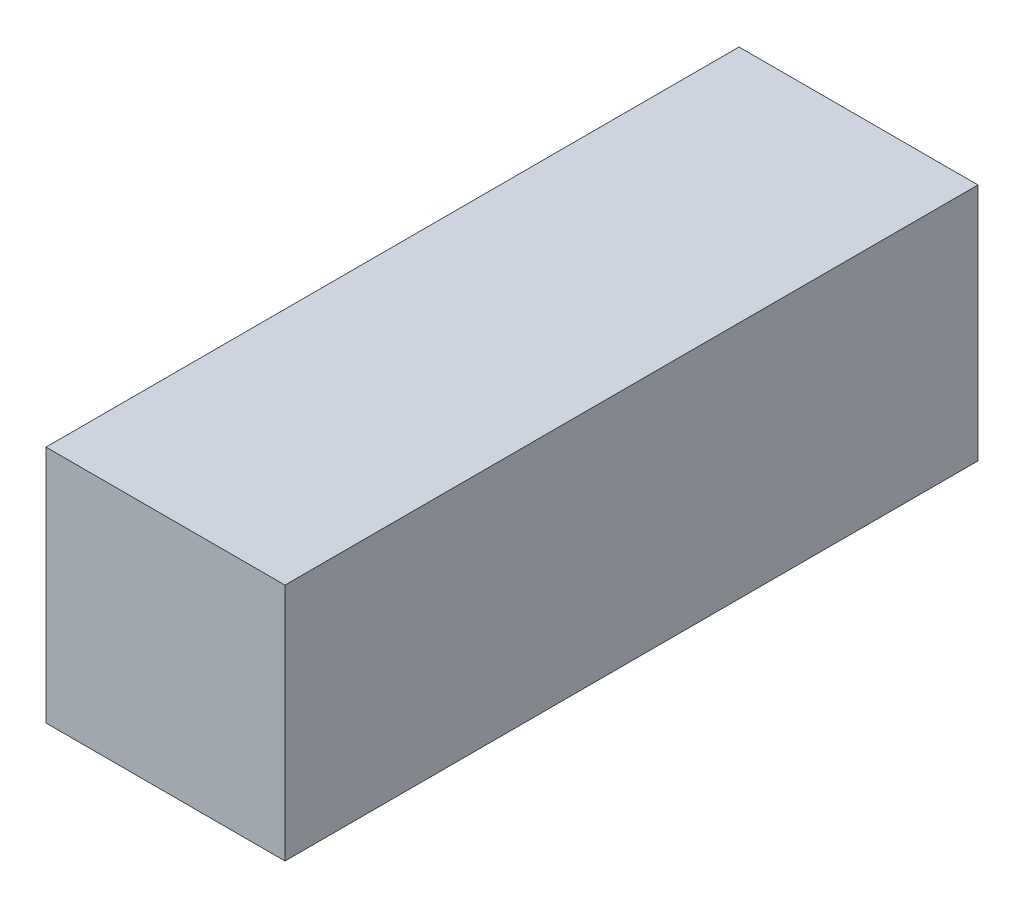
ISO-10303-21;
HEADER;
FILE_DESCRIPTION(('STEP AP214'),'2;1');
FILE_NAME('part.step','',(''),(''),'','','');
FILE_SCHEMA(('AUTOMOTIVE_DESIGN { 1 0 10303 214 1 1 1 1 }'));
ENDSEC;
DATA;
#1=APPLICATION_CONTEXT('core data for automotive mechanical design processes');
#2=APPLICATION_PROTOCOL_DEFINITION('international standard','automotive_design',2000,#1);
#3=PRODUCT_CONTEXT('',#1,'mechanical');
#4=PRODUCT('Part','Part','',(#3));
#5=PRODUCT_RELATED_PRODUCT_CATEGORY('part','',(#4));
#6=PRODUCT_DEFINITION_FORMATION('','',#4);
#7=PRODUCT_DEFINITION_CONTEXT('part definition',#1,'design');
#8=PRODUCT_DEFINITION('design','',#6,#7);
#9=PRODUCT_DEFINITION_SHAPE('','',#8);
#10=(LENGTH_UNIT() NAMED_UNIT(*) SI_UNIT(.MILLI.,.METRE.));
#11=(NAMED_UNIT(*) PLANE_ANGLE_UNIT() SI_UNIT($,.RADIAN.));
#12=(NAMED_UNIT(*) SI_UNIT($,.STERADIAN.) SOLID_ANGLE_UNIT());
#13=UNCERTAINTY_MEASURE_WITH_UNIT(LENGTH_MEASURE(1.E-05),#10,'distance_accuracy_value','');
#14=(GEOMETRIC_REPRESENTATION_CONTEXT(3) GLOBAL_UNCERTAINTY_ASSIGNED_CONTEXT((#13)) GLOBAL_UNIT_ASSIGNED_CONTEXT((#10,
#11,#12)) REPRESENTATION_CONTEXT('',''));
#15=CARTESIAN_POINT('',(0.,0.,0.));
#16=DIRECTION('',(0.,0.,1.));
#17=DIRECTION('',(1.,0.,0.));
#18=AXIS2_PLACEMENT_3D('',#15,#16,#17);
#19=CARTESIAN_POINT('',(0.,0.,58.));
#20=DIRECTION('',(1.,0.,0.));
#21=DIRECTION('',(0.,0.,-1.));
#22=AXIS2_PLACEMENT_3D('',#19,#20,#21);
#23=PLANE('',#22);
#24=DIRECTION('',(0.,-1.,0.));
#25=VECTOR('',#24,1.);
#26=CARTESIAN_POINT('',(0.,0.,0.));
#27=LINE('',#26,#25);
#28=CARTESIAN_POINT('',(0.,20.,0.));
#29=VERTEX_POINT('',#28);
#30=CARTESIAN_POINT('',(0.,0.,0.));
#31=VERTEX_POINT('',#30);
#32=EDGE_CURVE('E105',#29,#31,#27,.T.);
#33=ORIENTED_EDGE('',*,*,#32,.T.);
#34=DIRECTION('',(0.,0.,-1.));
#35=VECTOR('',#34,1.);
#36=CARTESIAN_POINT('',(0.,0.,58.));
#37=LINE('',#36,#35);
#38=CARTESIAN_POINT('',(0.,0.,58.));
#39=VERTEX_POINT('',#38);
#40=EDGE_CURVE('E11',#39,#31,#37,.T.);
#41=ORIENTED_EDGE('',*,*,#40,.F.);
#42=DIRECTION('',(0.,-1.,0.));
#43=VECTOR('',#42,1.);
#44=CARTESIAN_POINT('',(0.,0.,58.));
#45=LINE('',#44,#43);
#46=CARTESIAN_POINT('',(0.,20.,58.));
#47=VERTEX_POINT('',#46);
#48=EDGE_CURVE('E89',#47,#39,#45,.T.);
#49=ORIENTED_EDGE('',*,*,#48,.F.);
#50=DIRECTION('',(0.,0.,-1.));
#51=VECTOR('',#50,1.);
#52=CARTESIAN_POINT('',(0.,20.,58.));
#53=LINE('',#52,#51);
#54=EDGE_CURVE('E98',#47,#29,#53,.T.);
#55=ORIENTED_EDGE('',*,*,#54,.T.);
#56=EDGE_LOOP('',(#33,#41,#49,#55));
#57=FACE_BOUND('',#56,.T.);
#58=ADVANCED_FACE('F39',(#57),#23,.F.);
#59=CARTESIAN_POINT('',(0.,0.,58.));
#60=DIRECTION('',(0.,1.,0.));
#61=DIRECTION('',(0.,0.,1.));
#62=AXIS2_PLACEMENT_3D('',#59,#60,#61);
#63=PLANE('',#62);
#64=DIRECTION('',(1.,0.,0.));
#65=VECTOR('',#64,1.);
#66=CARTESIAN_POINT('',(0.,0.,0.));
#67=LINE('',#66,#65);
#68=CARTESIAN_POINT('',(20.,0.,0.));
#69=VERTEX_POINT('',#68);
#70=EDGE_CURVE('E94',#31,#69,#67,.T.);
#71=ORIENTED_EDGE('',*,*,#70,.T.);
#72=DIRECTION('',(0.,0.,-1.));
#73=VECTOR('',#72,1.);
#74=CARTESIAN_POINT('',(20.,0.,58.));
#75=LINE('',#74,#73);
#76=CARTESIAN_POINT('',(20.,0.,58.));
#77=VERTEX_POINT('',#76);
#78=EDGE_CURVE('E50',#77,#69,#75,.T.);
#79=ORIENTED_EDGE('',*,*,#78,.F.);
#80=DIRECTION('',(1.,0.,0.));
#81=VECTOR('',#80,1.);
#82=CARTESIAN_POINT('',(0.,0.,58.));
#83=LINE('',#82,#81);
#84=EDGE_CURVE('E83',#39,#77,#83,.T.);
#85=ORIENTED_EDGE('',*,*,#84,.F.);
#86=ORIENTED_EDGE('',*,*,#40,.T.);
#87=EDGE_LOOP('',(#71,#79,#85,#86));
#88=FACE_BOUND('',#87,.T.);
#89=ADVANCED_FACE('F91',(#88),#63,.F.);
#90=CARTESIAN_POINT('',(20.,0.,58.));
#91=DIRECTION('',(-1.,0.,0.));
#92=DIRECTION('',(0.,0.,1.));
#93=AXIS2_PLACEMENT_3D('',#90,#91,#92);
#94=PLANE('',#93);
#95=DIRECTION('',(0.,1.,0.));
#96=VECTOR('',#95,1.);
#97=CARTESIAN_POINT('',(20.,0.,0.));
#98=LINE('',#97,#96);
#99=CARTESIAN_POINT('',(20.,20.,0.));
#100=VERTEX_POINT('',#99);
#101=EDGE_CURVE('E75',#69,#100,#98,.T.);
#102=ORIENTED_EDGE('',*,*,#101,.T.);
#103=DIRECTION('',(0.,0.,-1.));
#104=VECTOR('',#103,1.);
#105=CARTESIAN_POINT('',(20.,20.,58.));
#106=LINE('',#105,#104);
#107=CARTESIAN_POINT('',(20.,20.,58.));
#108=VERTEX_POINT('',#107);
#109=EDGE_CURVE('E92',#108,#100,#106,.T.);
#110=ORIENTED_EDGE('',*,*,#109,.F.);
#111=DIRECTION('',(0.,1.,0.));
#112=VECTOR('',#111,1.);
#113=CARTESIAN_POINT('',(20.,0.,58.));
#114=LINE('',#113,#112);
#115=EDGE_CURVE('E86',#77,#108,#114,.T.);
#116=ORIENTED_EDGE('',*,*,#115,.F.);
#117=ORIENTED_EDGE('',*,*,#78,.T.);
#118=EDGE_LOOP('',(#102,#110,#116,#117));
#119=FACE_BOUND('',#118,.T.);
#120=ADVANCED_FACE('F96',(#119),#94,.F.);
#121=CARTESIAN_POINT('',(0.,20.,58.));
#122=DIRECTION('',(0.,-1.,0.));
#123=DIRECTION('',(0.,0.,-1.));
#124=AXIS2_PLACEMENT_3D('',#121,#122,#123);
#125=PLANE('',#124);
#126=DIRECTION('',(-1.,0.,0.));
#127=VECTOR('',#126,1.);
#128=CARTESIAN_POINT('',(0.,20.,0.));
#129=LINE('',#128,#127);
#130=EDGE_CURVE('E77',#100,#29,#129,.T.);
#131=ORIENTED_EDGE('',*,*,#130,.T.);
#132=ORIENTED_EDGE('',*,*,#54,.F.);
#133=DIRECTION('',(-1.,0.,0.));
#134=VECTOR('',#133,1.);
#135=CARTESIAN_POINT('',(0.,20.,58.));
#136=LINE('',#135,#134);
#137=EDGE_CURVE('E54',#108,#47,#136,.T.);
#138=ORIENTED_EDGE('',*,*,#137,.F.);
#139=ORIENTED_EDGE('',*,*,#109,.T.);
#140=EDGE_LOOP('',(#131,#132,#138,#139));
#141=FACE_BOUND('',#140,.T.);
#142=ADVANCED_FACE('F108',(#141),#125,.F.);
#143=CARTESIAN_POINT('',(0.,0.,58.));
#144=DIRECTION('',(0.,0.,-1.));
#145=DIRECTION('',(-1.,0.,0.));
#146=AXIS2_PLACEMENT_3D('',#143,#144,#145);
#147=PLANE('',#146);
#148=ORIENTED_EDGE('',*,*,#48,.T.);
#149=ORIENTED_EDGE('',*,*,#84,.T.);
#150=ORIENTED_EDGE('',*,*,#115,.T.);
#151=ORIENTED_EDGE('',*,*,#137,.T.);
#152=EDGE_LOOP('',(#148,#149,#150,#151));
#153=FACE_BOUND('',#152,.T.);
#154=ADVANCED_FACE('F88',(#153),#147,.F.);
#155=CARTESIAN_POINT('',(0.,0.,0.));
#156=DIRECTION('',(0.,0.,-1.));
#157=DIRECTION('',(-1.,0.,0.));
#158=AXIS2_PLACEMENT_3D('',#155,#156,#157);
#159=PLANE('',#158);
#160=ORIENTED_EDGE('',*,*,#32,.F.);
#161=ORIENTED_EDGE('',*,*,#130,.F.);
#162=ORIENTED_EDGE('',*,*,#101,.F.);
#163=ORIENTED_EDGE('',*,*,#70,.F.);
#164=EDGE_LOOP('',(#160,#161,#162,#163));
#165=FACE_BOUND('',#164,.T.);
#166=ADVANCED_FACE('F115',(#165),#159,.T.);
#167=CLOSED_SHELL('',(#58,#89,#120,#142,#154,#166));
#168=MANIFOLD_SOLID_BREP('B2',#167);
#169=ADVANCED_BREP_SHAPE_REPRESENTATION('',(#18,#168),#14);
#170=SHAPE_DEFINITION_REPRESENTATION(#9,#169);
ENDSEC;
END-ISO-10303-21;
